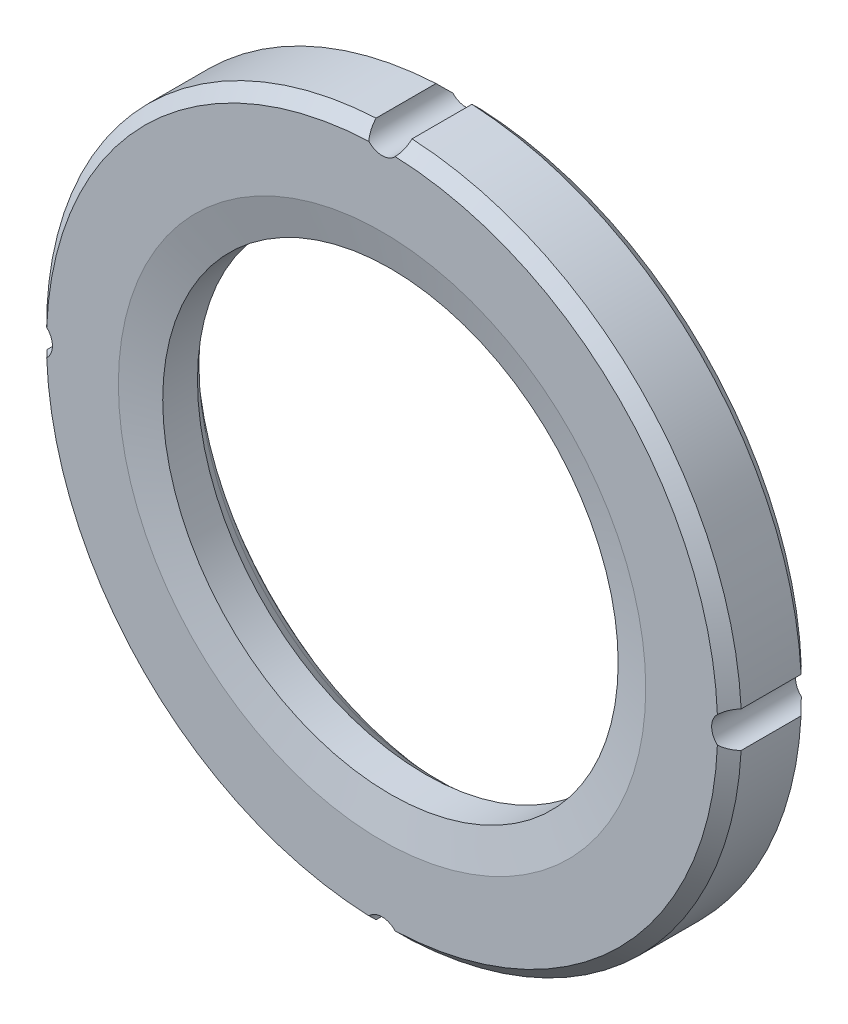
from build123d import *

# Parameters (mm, degrees)
CUT_EXTRUDE_START   = 10
CUT_EXTRUDE_2_DEPTH = 10


with BuildPart() as part:
    # Sketch 4 → Revolve 1 (revolve)
    with BuildSketch(Plane(origin=(0, 0, 0), x_dir=(1, 0, 0), z_dir=(0, 1, 0)), mode=Mode.PRIVATE) as revolve_1_sk:
        Polygon((22.789601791, 0), (28, 0), (29, -1), (29, -6), (28, -7), (22, -7), (19, -6.3), (19, -3.4), (20.080484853, -2.2), (21.413219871, -1), align=None)
    revolve(revolve_1_sk.sketch.rotate(Axis((0, 0, -37.928878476), (0, 0, 1)), 180), axis=Axis((0, 0, -37.928878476), (0, 0, 1)))

    # Sketch 5 → Cut-Extrude 2 (cut)
    with BuildSketch(Plane.XY.offset(CUT_EXTRUDE_START)):
        with BuildLine():
            ThreePointArc((-1.499498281, 28.961206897), (0, 27.5), (1.499498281, 28.961206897))
            ThreePointArc((1.499498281, 28.961206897), (0, 29), (-1.499498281, 28.961206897))
        make_face()
        with BuildLine():
            ThreePointArc((28.961206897, 1.499498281), (27.5, 0), (28.961206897, -1.499498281))
            ThreePointArc((28.961206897, -1.499498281), (29, 0), (28.961206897, 1.499498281))
        make_face()
        with BuildLine():
            ThreePointArc((1.499498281, -28.961206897), (0, -27.5), (-1.499498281, -28.961206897))
            ThreePointArc((-1.499498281, -28.961206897), (0, -29), (1.499498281, -28.961206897))
        make_face()
        with BuildLine():
            ThreePointArc((-28.961206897, -1.499498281), (-27.5, 0), (-28.961206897, 1.499498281))
            ThreePointArc((-28.961206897, 1.499498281), (-29, 0), (-28.961206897, -1.499498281))
        make_face()
    extrude(amount=-CUT_EXTRUDE_2_DEPTH, mode=Mode.SUBTRACT)


solid = part.part
